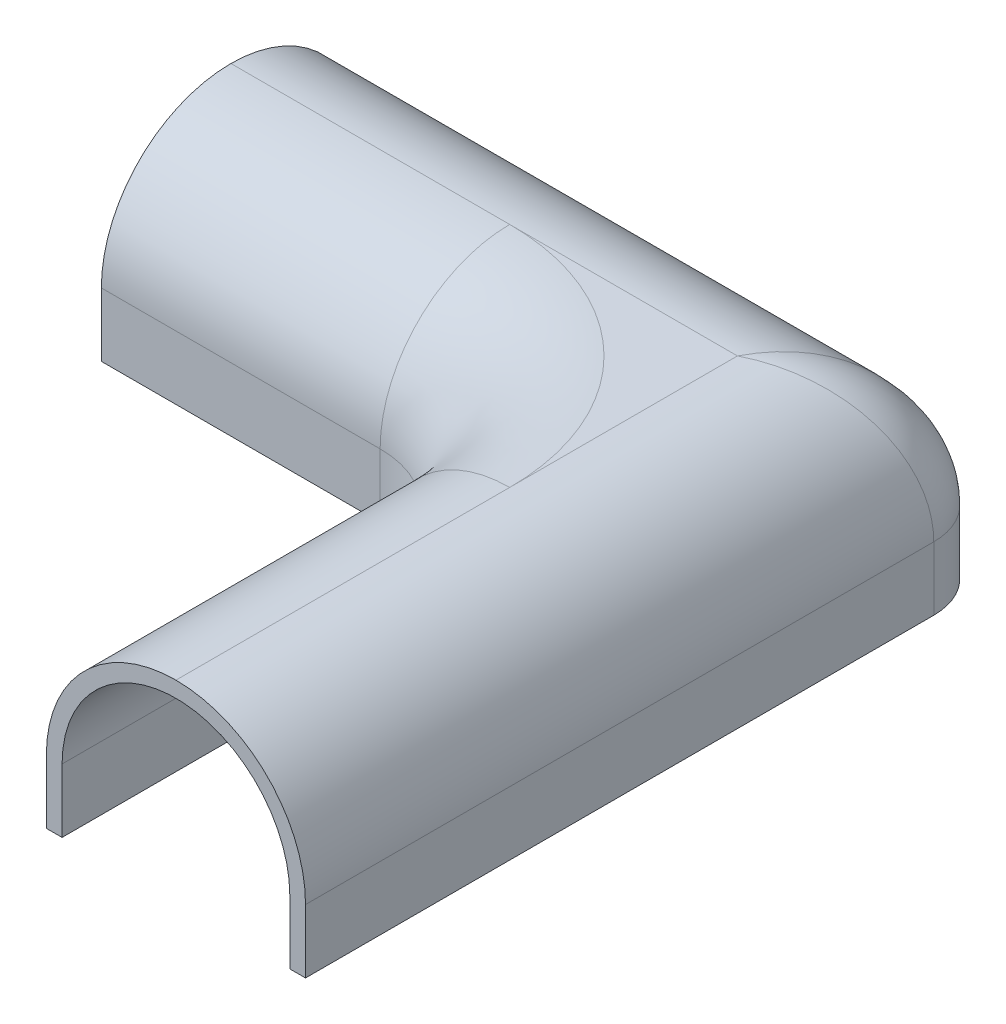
ISO-10303-21;
HEADER;
FILE_DESCRIPTION(('STEP AP214'),'2;1');
FILE_NAME('part.step','',(''),(''),'','','');
FILE_SCHEMA(('AUTOMOTIVE_DESIGN { 1 0 10303 214 1 1 1 1 }'));
ENDSEC;
DATA;
#1=APPLICATION_CONTEXT('core data for automotive mechanical design processes');
#2=APPLICATION_PROTOCOL_DEFINITION('international standard','automotive_design',2000,#1);
#3=PRODUCT_CONTEXT('',#1,'mechanical');
#4=PRODUCT('Part','Part','',(#3));
#5=PRODUCT_RELATED_PRODUCT_CATEGORY('part','',(#4));
#6=PRODUCT_DEFINITION_FORMATION('','',#4);
#7=PRODUCT_DEFINITION_CONTEXT('part definition',#1,'design');
#8=PRODUCT_DEFINITION('design','',#6,#7);
#9=PRODUCT_DEFINITION_SHAPE('','',#8);
#10=(LENGTH_UNIT() NAMED_UNIT(*) SI_UNIT(.MILLI.,.METRE.));
#11=(NAMED_UNIT(*) PLANE_ANGLE_UNIT() SI_UNIT($,.RADIAN.));
#12=(NAMED_UNIT(*) SI_UNIT($,.STERADIAN.) SOLID_ANGLE_UNIT());
#13=UNCERTAINTY_MEASURE_WITH_UNIT(LENGTH_MEASURE(1.E-05),#10,'distance_accuracy_value','');
#14=(GEOMETRIC_REPRESENTATION_CONTEXT(3) GLOBAL_UNCERTAINTY_ASSIGNED_CONTEXT((#13)) GLOBAL_UNIT_ASSIGNED_CONTEXT((#10,
#11,#12)) REPRESENTATION_CONTEXT('',''));
#15=CARTESIAN_POINT('',(0.,0.,0.));
#16=DIRECTION('',(0.,0.,1.));
#17=DIRECTION('',(1.,0.,0.));
#18=AXIS2_PLACEMENT_3D('',#15,#16,#17);
#19=CARTESIAN_POINT('',(-32.25,12.3,-8.25));
#20=DIRECTION('',(1.,0.,0.));
#21=DIRECTION('',(0.,0.,-1.));
#22=AXIS2_PLACEMENT_3D('',#19,#20,#21);
#23=PLANE('',#22);
#24=CARTESIAN_POINT('',(-32.25,4.05,0.));
#25=DIRECTION('',(1.,0.,0.));
#26=DIRECTION('',(0.,0.,-1.));
#27=AXIS2_PLACEMENT_3D('',#24,#25,#26);
#28=CIRCLE('',#27,8.25);
#29=CARTESIAN_POINT('',(-32.25,4.05,8.25));
#30=VERTEX_POINT('',#29);
#31=CARTESIAN_POINT('',(-32.25,12.3,0.));
#32=VERTEX_POINT('',#31);
#33=EDGE_CURVE('E380',#30,#32,#28,.F.);
#34=ORIENTED_EDGE('',*,*,#33,.T.);
#35=CARTESIAN_POINT('',(-32.25,4.05,0.));
#36=DIRECTION('',(1.,0.,0.));
#37=DIRECTION('',(0.,0.,-1.));
#38=AXIS2_PLACEMENT_3D('',#35,#36,#37);
#39=CIRCLE('',#38,8.25);
#40=CARTESIAN_POINT('',(-32.25,4.05,-8.25));
#41=VERTEX_POINT('',#40);
#42=EDGE_CURVE('E47',#32,#41,#39,.F.);
#43=ORIENTED_EDGE('',*,*,#42,.T.);
#44=DIRECTION('',(0.,-1.,0.));
#45=VECTOR('',#44,1.);
#46=CARTESIAN_POINT('',(-32.25,12.3,-8.25));
#47=LINE('',#46,#45);
#48=CARTESIAN_POINT('',(-32.25,0.,-8.25));
#49=VERTEX_POINT('',#48);
#50=EDGE_CURVE('E307',#41,#49,#47,.T.);
#51=ORIENTED_EDGE('',*,*,#50,.T.);
#52=DIRECTION('',(0.,0.,1.));
#53=VECTOR('',#52,1.);
#54=CARTESIAN_POINT('',(-32.25,0.,-8.25));
#55=LINE('',#54,#53);
#56=CARTESIAN_POINT('',(-32.25,0.,8.25));
#57=VERTEX_POINT('',#56);
#58=EDGE_CURVE('E274',#49,#57,#55,.T.);
#59=ORIENTED_EDGE('',*,*,#58,.T.);
#60=DIRECTION('',(0.,-1.,0.));
#61=VECTOR('',#60,1.);
#62=CARTESIAN_POINT('',(-32.25,12.3,8.25));
#63=LINE('',#62,#61);
#64=EDGE_CURVE('E314',#30,#57,#63,.T.);
#65=ORIENTED_EDGE('',*,*,#64,.F.);
#66=EDGE_LOOP('',(#34,#43,#51,#59,#65));
#67=FACE_BOUND('',#66,.T.);
#68=ADVANCED_FACE('F33',(#67),#23,.F.);
#69=CARTESIAN_POINT('',(-8.24999999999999,12.3,8.25));
#70=DIRECTION('',(0.,0.,-1.));
#71=DIRECTION('',(-1.,0.,0.));
#72=AXIS2_PLACEMENT_3D('',#69,#70,#71);
#73=PLANE('',#72);
#74=DIRECTION('',(0.,-1.,0.));
#75=VECTOR('',#74,1.);
#76=CARTESIAN_POINT('',(-14.5,12.3,8.25));
#77=LINE('',#76,#75);
#78=CARTESIAN_POINT('',(-14.5,0.,8.25));
#79=VERTEX_POINT('',#78);
#80=CARTESIAN_POINT('',(-14.5,4.05,8.25));
#81=VERTEX_POINT('',#80);
#82=EDGE_CURVE('E318',#79,#81,#77,.F.);
#83=ORIENTED_EDGE('',*,*,#82,.T.);
#84=DIRECTION('',(1.,0.,0.));
#85=VECTOR('',#84,1.);
#86=CARTESIAN_POINT('',(-32.25,4.05,8.25));
#87=LINE('',#86,#85);
#88=EDGE_CURVE('E11',#81,#30,#87,.F.);
#89=ORIENTED_EDGE('',*,*,#88,.T.);
#90=ORIENTED_EDGE('',*,*,#64,.T.);
#91=DIRECTION('',(1.,0.,0.));
#92=VECTOR('',#91,1.);
#93=CARTESIAN_POINT('',(-8.24999999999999,0.,8.25));
#94=LINE('',#93,#92);
#95=EDGE_CURVE('E293',#57,#79,#94,.T.);
#96=ORIENTED_EDGE('',*,*,#95,.T.);
#97=EDGE_LOOP('',(#83,#89,#90,#96));
#98=FACE_BOUND('',#97,.T.);
#99=ADVANCED_FACE('F465',(#98),#73,.F.);
#100=CARTESIAN_POINT('',(-8.24999999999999,12.3,35.75));
#101=DIRECTION('',(1.,0.,0.));
#102=DIRECTION('',(0.,0.,-1.));
#103=AXIS2_PLACEMENT_3D('',#100,#101,#102);
#104=PLANE('',#103);
#105=DIRECTION('',(0.,-1.,0.));
#106=VECTOR('',#105,1.);
#107=CARTESIAN_POINT('',(-8.24999999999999,12.3,35.75));
#108=LINE('',#107,#106);
#109=CARTESIAN_POINT('',(-8.24999999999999,4.05,35.75));
#110=VERTEX_POINT('',#109);
#111=CARTESIAN_POINT('',(-8.24999999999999,0.,35.75));
#112=VERTEX_POINT('',#111);
#113=EDGE_CURVE('E312',#110,#112,#108,.T.);
#114=ORIENTED_EDGE('',*,*,#113,.F.);
#115=DIRECTION('',(0.,0.,1.));
#116=VECTOR('',#115,1.);
#117=CARTESIAN_POINT('',(-8.24999999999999,4.05,14.5));
#118=LINE('',#117,#116);
#119=CARTESIAN_POINT('',(-8.24999999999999,4.05,14.5));
#120=VERTEX_POINT('',#119);
#121=EDGE_CURVE('E376',#110,#120,#118,.F.);
#122=ORIENTED_EDGE('',*,*,#121,.T.);
#123=DIRECTION('',(0.,-1.,0.));
#124=VECTOR('',#123,1.);
#125=CARTESIAN_POINT('',(-8.24999999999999,0.,14.5));
#126=LINE('',#125,#124);
#127=CARTESIAN_POINT('',(-8.24999999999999,0.,14.5));
#128=VERTEX_POINT('',#127);
#129=EDGE_CURVE('E316',#120,#128,#126,.T.);
#130=ORIENTED_EDGE('',*,*,#129,.T.);
#131=DIRECTION('',(0.,0.,1.));
#132=VECTOR('',#131,1.);
#133=CARTESIAN_POINT('',(-8.24999999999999,0.,35.75));
#134=LINE('',#133,#132);
#135=EDGE_CURVE('E296',#128,#112,#134,.T.);
#136=ORIENTED_EDGE('',*,*,#135,.T.);
#137=EDGE_LOOP('',(#114,#122,#130,#136));
#138=FACE_BOUND('',#137,.T.);
#139=ADVANCED_FACE('F469',(#138),#104,.F.);
#140=CARTESIAN_POINT('',(-8.24999999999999,12.3,35.75));
#141=DIRECTION('',(0.,0.,-1.));
#142=DIRECTION('',(-1.,0.,0.));
#143=AXIS2_PLACEMENT_3D('',#140,#141,#142);
#144=PLANE('',#143);
#145=CARTESIAN_POINT('',(0.,4.04999999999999,35.75));
#146=DIRECTION('',(0.,0.,1.));
#147=DIRECTION('',(-1.,0.,0.));
#148=AXIS2_PLACEMENT_3D('',#145,#146,#147);
#149=CIRCLE('',#148,7.25);
#150=CARTESIAN_POINT('',(7.25000000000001,4.05,35.75));
#151=VERTEX_POINT('',#150);
#152=CARTESIAN_POINT('',(-7.25,4.05,35.75));
#153=VERTEX_POINT('',#152);
#154=EDGE_CURVE('E191',#151,#153,#149,.T.);
#155=ORIENTED_EDGE('',*,*,#154,.F.);
#156=DIRECTION('',(0.,1.,0.));
#157=VECTOR('',#156,1.);
#158=CARTESIAN_POINT('',(7.25000000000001,4.05,35.75));
#159=LINE('',#158,#157);
#160=CARTESIAN_POINT('',(7.25000000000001,0.,35.75));
#161=VERTEX_POINT('',#160);
#162=EDGE_CURVE('E202',#161,#151,#159,.T.);
#163=ORIENTED_EDGE('',*,*,#162,.F.);
#164=DIRECTION('',(1.,0.,0.));
#165=VECTOR('',#164,1.);
#166=CARTESIAN_POINT('',(-8.24999999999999,0.,35.75));
#167=LINE('',#166,#165);
#168=CARTESIAN_POINT('',(8.25000000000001,0.,35.75));
#169=VERTEX_POINT('',#168);
#170=EDGE_CURVE('E299',#161,#169,#167,.T.);
#171=ORIENTED_EDGE('',*,*,#170,.T.);
#172=DIRECTION('',(0.,-1.,0.));
#173=VECTOR('',#172,1.);
#174=CARTESIAN_POINT('',(8.25000000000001,12.3,35.75));
#175=LINE('',#174,#173);
#176=CARTESIAN_POINT('',(8.25000000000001,4.05,35.75));
#177=VERTEX_POINT('',#176);
#178=EDGE_CURVE('E309',#177,#169,#175,.T.);
#179=ORIENTED_EDGE('',*,*,#178,.F.);
#180=CARTESIAN_POINT('',(0.,4.05,35.75));
#181=DIRECTION('',(0.,0.,-1.));
#182=DIRECTION('',(-1.,0.,0.));
#183=AXIS2_PLACEMENT_3D('',#180,#181,#182);
#184=CIRCLE('',#183,8.25);
#185=CARTESIAN_POINT('',(0.,12.3,35.75));
#186=VERTEX_POINT('',#185);
#187=EDGE_CURVE('E372',#177,#186,#184,.F.);
#188=ORIENTED_EDGE('',*,*,#187,.T.);
#189=CARTESIAN_POINT('',(0.,4.05,35.75));
#190=DIRECTION('',(0.,0.,-1.));
#191=DIRECTION('',(-1.,0.,0.));
#192=AXIS2_PLACEMENT_3D('',#189,#190,#191);
#193=CIRCLE('',#192,8.25);
#194=EDGE_CURVE('E370',#186,#110,#193,.F.);
#195=ORIENTED_EDGE('',*,*,#194,.T.);
#196=ORIENTED_EDGE('',*,*,#113,.T.);
#197=CARTESIAN_POINT('',(-7.25,0.,35.75));
#198=VERTEX_POINT('',#197);
#199=EDGE_CURVE('E201',#112,#198,#167,.T.);
#200=ORIENTED_EDGE('',*,*,#199,.T.);
#201=DIRECTION('',(0.,-1.,0.));
#202=VECTOR('',#201,1.);
#203=CARTESIAN_POINT('',(-7.25,4.05,35.75));
#204=LINE('',#203,#202);
#205=EDGE_CURVE('E180',#153,#198,#204,.T.);
#206=ORIENTED_EDGE('',*,*,#205,.F.);
#207=EDGE_LOOP('',(#155,#163,#171,#179,#188,#195,#196,#200,#206));
#208=FACE_BOUND('',#207,.T.);
#209=ADVANCED_FACE('F199',(#208),#144,.F.);
#210=CARTESIAN_POINT('',(8.25,12.3,-8.25));
#211=DIRECTION('',(-1.,0.,0.));
#212=DIRECTION('',(0.,0.,1.));
#213=AXIS2_PLACEMENT_3D('',#210,#211,#212);
#214=PLANE('',#213);
#215=DIRECTION('',(0.,-1.,0.));
#216=VECTOR('',#215,1.);
#217=CARTESIAN_POINT('',(8.25,12.3,-4.25));
#218=LINE('',#217,#216);
#219=CARTESIAN_POINT('',(8.25,0.,-4.25));
#220=VERTEX_POINT('',#219);
#221=CARTESIAN_POINT('',(8.25,4.05,-4.25));
#222=VERTEX_POINT('',#221);
#223=EDGE_CURVE('E338',#220,#222,#218,.F.);
#224=ORIENTED_EDGE('',*,*,#223,.T.);
#225=DIRECTION('',(0.,0.,-1.));
#226=VECTOR('',#225,1.);
#227=CARTESIAN_POINT('',(8.25000000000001,4.05,35.75));
#228=LINE('',#227,#226);
#229=EDGE_CURVE('E367',#222,#177,#228,.F.);
#230=ORIENTED_EDGE('',*,*,#229,.T.);
#231=ORIENTED_EDGE('',*,*,#178,.T.);
#232=DIRECTION('',(0.,0.,-1.));
#233=VECTOR('',#232,1.);
#234=CARTESIAN_POINT('',(8.25,0.,-8.25));
#235=LINE('',#234,#233);
#236=EDGE_CURVE('E301',#169,#220,#235,.T.);
#237=ORIENTED_EDGE('',*,*,#236,.T.);
#238=EDGE_LOOP('',(#224,#230,#231,#237));
#239=FACE_BOUND('',#238,.T.);
#240=ADVANCED_FACE('F401',(#239),#214,.F.);
#241=CARTESIAN_POINT('',(-32.25,12.3,-8.25));
#242=DIRECTION('',(0.,0.,1.));
#243=DIRECTION('',(1.,0.,0.));
#244=AXIS2_PLACEMENT_3D('',#241,#242,#243);
#245=PLANE('',#244);
#246=ORIENTED_EDGE('',*,*,#50,.F.);
#247=DIRECTION('',(-1.,0.,0.));
#248=VECTOR('',#247,1.);
#249=CARTESIAN_POINT('',(4.25,4.05,-8.25));
#250=LINE('',#249,#248);
#251=CARTESIAN_POINT('',(4.25,4.05,-8.25));
#252=VERTEX_POINT('',#251);
#253=EDGE_CURVE('E40',#41,#252,#250,.F.);
#254=ORIENTED_EDGE('',*,*,#253,.T.);
#255=DIRECTION('',(0.,-1.,0.));
#256=VECTOR('',#255,1.);
#257=CARTESIAN_POINT('',(4.25,12.3,-8.25));
#258=LINE('',#257,#256);
#259=CARTESIAN_POINT('',(4.25,0.,-8.25));
#260=VERTEX_POINT('',#259);
#261=EDGE_CURVE('E334',#252,#260,#258,.T.);
#262=ORIENTED_EDGE('',*,*,#261,.T.);
#263=DIRECTION('',(-1.,0.,0.));
#264=VECTOR('',#263,1.);
#265=CARTESIAN_POINT('',(-32.25,0.,-8.25));
#266=LINE('',#265,#264);
#267=EDGE_CURVE('E304',#260,#49,#266,.T.);
#268=ORIENTED_EDGE('',*,*,#267,.T.);
#269=EDGE_LOOP('',(#246,#254,#262,#268));
#270=FACE_BOUND('',#269,.T.);
#271=ADVANCED_FACE('F385',(#270),#245,.F.);
#272=CARTESIAN_POINT('',(-32.25,12.3,35.75));
#273=DIRECTION('',(0.,1.,0.));
#274=DIRECTION('',(0.,0.,1.));
#275=AXIS2_PLACEMENT_3D('',#272,#273,#274);
#276=PLANE('',#275);
#277=CARTESIAN_POINT('',(-14.5,12.3,14.5));
#278=DIRECTION('',(0.,1.,0.));
#279=DIRECTION('',(0.,0.,1.));
#280=AXIS2_PLACEMENT_3D('',#277,#278,#279);
#281=CIRCLE('',#280,14.5);
#282=CARTESIAN_POINT('',(-14.5,12.3,0.));
#283=VERTEX_POINT('',#282);
#284=CARTESIAN_POINT('',(0.,12.3,14.5));
#285=VERTEX_POINT('',#284);
#286=EDGE_CURVE('E362',#283,#285,#281,.F.);
#287=ORIENTED_EDGE('',*,*,#286,.T.);
#288=DIRECTION('',(0.,0.,-1.));
#289=VECTOR('',#288,1.);
#290=CARTESIAN_POINT('',(0.,12.3,-4.25));
#291=LINE('',#290,#289);
#292=CARTESIAN_POINT('',(0.,12.3,0.));
#293=VERTEX_POINT('',#292);
#294=EDGE_CURVE('E364',#285,#293,#291,.T.);
#295=ORIENTED_EDGE('',*,*,#294,.T.);
#296=DIRECTION('',(-1.,0.,0.));
#297=VECTOR('',#296,1.);
#298=CARTESIAN_POINT('',(-32.25,12.3,0.));
#299=LINE('',#298,#297);
#300=EDGE_CURVE('E360',#293,#283,#299,.T.);
#301=ORIENTED_EDGE('',*,*,#300,.T.);
#302=EDGE_LOOP('',(#287,#295,#301));
#303=FACE_BOUND('',#302,.T.);
#304=ADVANCED_FACE('F482',(#303),#276,.T.);
#305=CARTESIAN_POINT('',(-32.25,0.,35.75));
#306=DIRECTION('',(0.,1.,0.));
#307=DIRECTION('',(0.,0.,1.));
#308=AXIS2_PLACEMENT_3D('',#305,#306,#307);
#309=PLANE('',#308);
#310=ORIENTED_EDGE('',*,*,#170,.F.);
#311=DIRECTION('',(0.,0.,-1.));
#312=VECTOR('',#311,1.);
#313=CARTESIAN_POINT('',(7.25,0.,-8.25));
#314=LINE('',#313,#312);
#315=CARTESIAN_POINT('',(7.25,0.,-4.25));
#316=VERTEX_POINT('',#315);
#317=EDGE_CURVE('E284',#161,#316,#314,.T.);
#318=ORIENTED_EDGE('',*,*,#317,.T.);
#319=CARTESIAN_POINT('',(4.25,0.,-4.25));
#320=DIRECTION('',(0.,1.,0.));
#321=DIRECTION('',(0.,0.,1.));
#322=AXIS2_PLACEMENT_3D('',#319,#320,#321);
#323=CIRCLE('',#322,3.);
#324=CARTESIAN_POINT('',(4.25,0.,-7.25));
#325=VERTEX_POINT('',#324);
#326=EDGE_CURVE('E332',#316,#325,#323,.T.);
#327=ORIENTED_EDGE('',*,*,#326,.T.);
#328=DIRECTION('',(-1.,0.,0.));
#329=VECTOR('',#328,1.);
#330=CARTESIAN_POINT('',(-32.25,0.,-7.25));
#331=LINE('',#330,#329);
#332=CARTESIAN_POINT('',(-31.25,0.,-7.25));
#333=VERTEX_POINT('',#332);
#334=EDGE_CURVE('E277',#325,#333,#331,.T.);
#335=ORIENTED_EDGE('',*,*,#334,.T.);
#336=DIRECTION('',(0.,0.,1.));
#337=VECTOR('',#336,1.);
#338=CARTESIAN_POINT('',(-31.25,0.,-8.25));
#339=LINE('',#338,#337);
#340=CARTESIAN_POINT('',(-31.25,0.,7.25));
#341=VERTEX_POINT('',#340);
#342=EDGE_CURVE('E278',#333,#341,#339,.T.);
#343=ORIENTED_EDGE('',*,*,#342,.T.);
#344=DIRECTION('',(1.,0.,0.));
#345=VECTOR('',#344,1.);
#346=CARTESIAN_POINT('',(-8.24999999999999,0.,7.25));
#347=LINE('',#346,#345);
#348=CARTESIAN_POINT('',(-14.5,0.,7.25));
#349=VERTEX_POINT('',#348);
#350=EDGE_CURVE('E281',#341,#349,#347,.T.);
#351=ORIENTED_EDGE('',*,*,#350,.T.);
#352=CARTESIAN_POINT('',(-14.5,0.,14.5));
#353=DIRECTION('',(0.,1.,0.));
#354=DIRECTION('',(0.,0.,1.));
#355=AXIS2_PLACEMENT_3D('',#352,#353,#354);
#356=CIRCLE('',#355,7.25);
#357=CARTESIAN_POINT('',(-7.25,0.,14.5));
#358=VERTEX_POINT('',#357);
#359=EDGE_CURVE('E324',#349,#358,#356,.F.);
#360=ORIENTED_EDGE('',*,*,#359,.T.);
#361=DIRECTION('',(0.,0.,1.));
#362=VECTOR('',#361,1.);
#363=CARTESIAN_POINT('',(-7.25,0.,35.75));
#364=LINE('',#363,#362);
#365=EDGE_CURVE('E287',#358,#198,#364,.T.);
#366=ORIENTED_EDGE('',*,*,#365,.T.);
#367=ORIENTED_EDGE('',*,*,#199,.F.);
#368=ORIENTED_EDGE('',*,*,#135,.F.);
#369=CARTESIAN_POINT('',(-14.5,0.,14.5));
#370=DIRECTION('',(0.,1.,0.));
#371=DIRECTION('',(0.,0.,1.));
#372=AXIS2_PLACEMENT_3D('',#369,#370,#371);
#373=CIRCLE('',#372,6.25);
#374=EDGE_CURVE('E320',#128,#79,#373,.T.);
#375=ORIENTED_EDGE('',*,*,#374,.T.);
#376=ORIENTED_EDGE('',*,*,#95,.F.);
#377=ORIENTED_EDGE('',*,*,#58,.F.);
#378=ORIENTED_EDGE('',*,*,#267,.F.);
#379=CARTESIAN_POINT('',(4.25,0.,-4.25));
#380=DIRECTION('',(0.,1.,0.));
#381=DIRECTION('',(0.,0.,1.));
#382=AXIS2_PLACEMENT_3D('',#379,#380,#381);
#383=CIRCLE('',#382,4.);
#384=EDGE_CURVE('E336',#260,#220,#383,.F.);
#385=ORIENTED_EDGE('',*,*,#384,.T.);
#386=ORIENTED_EDGE('',*,*,#236,.F.);
#387=EDGE_LOOP('',(#310,#318,#327,#335,#343,#351,#360,#366,#367,#368,#375,#376,#377,#378,#385,#386));
#388=FACE_BOUND('',#387,.T.);
#389=ADVANCED_FACE('F406',(#388),#309,.F.);
#390=CARTESIAN_POINT('',(-31.25,12.3,-8.25));
#391=DIRECTION('',(1.,0.,0.));
#392=DIRECTION('',(0.,0.,-1.));
#393=AXIS2_PLACEMENT_3D('',#390,#391,#392);
#394=PLANE('',#393);
#395=CARTESIAN_POINT('',(-31.25,4.05,0.));
#396=DIRECTION('',(1.,0.,0.));
#397=DIRECTION('',(0.,0.,-1.));
#398=AXIS2_PLACEMENT_3D('',#395,#396,#397);
#399=CIRCLE('',#398,7.25);
#400=CARTESIAN_POINT('',(-31.25,4.05,-7.25));
#401=VERTEX_POINT('',#400);
#402=CARTESIAN_POINT('',(-31.25,11.3,0.));
#403=VERTEX_POINT('',#402);
#404=EDGE_CURVE('E344',#401,#403,#399,.T.);
#405=ORIENTED_EDGE('',*,*,#404,.T.);
#406=CARTESIAN_POINT('',(-31.25,4.05,0.));
#407=DIRECTION('',(1.,0.,0.));
#408=DIRECTION('',(0.,0.,-1.));
#409=AXIS2_PLACEMENT_3D('',#406,#407,#408);
#410=CIRCLE('',#409,7.25);
#411=CARTESIAN_POINT('',(-31.25,4.05,7.25));
#412=VERTEX_POINT('',#411);
#413=EDGE_CURVE('E346',#403,#412,#410,.T.);
#414=ORIENTED_EDGE('',*,*,#413,.T.);
#415=DIRECTION('',(0.,-1.,0.));
#416=VECTOR('',#415,1.);
#417=CARTESIAN_POINT('',(-31.25,12.3,7.25));
#418=LINE('',#417,#416);
#419=EDGE_CURVE('E272',#412,#341,#418,.T.);
#420=ORIENTED_EDGE('',*,*,#419,.T.);
#421=ORIENTED_EDGE('',*,*,#342,.F.);
#422=DIRECTION('',(0.,-1.,0.));
#423=VECTOR('',#422,1.);
#424=CARTESIAN_POINT('',(-31.25,12.3,-7.25));
#425=LINE('',#424,#423);
#426=EDGE_CURVE('E275',#401,#333,#425,.T.);
#427=ORIENTED_EDGE('',*,*,#426,.F.);
#428=EDGE_LOOP('',(#405,#414,#420,#421,#427));
#429=FACE_BOUND('',#428,.T.);
#430=ADVANCED_FACE('F445',(#429),#394,.T.);
#431=CARTESIAN_POINT('',(-8.24999999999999,12.3,7.25));
#432=DIRECTION('',(0.,0.,-1.));
#433=DIRECTION('',(-1.,0.,0.));
#434=AXIS2_PLACEMENT_3D('',#431,#432,#433);
#435=PLANE('',#434);
#436=ORIENTED_EDGE('',*,*,#419,.F.);
#437=DIRECTION('',(1.,0.,0.));
#438=VECTOR('',#437,1.);
#439=CARTESIAN_POINT('',(-8.24999999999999,4.05,7.25));
#440=LINE('',#439,#438);
#441=CARTESIAN_POINT('',(-14.5,4.05,7.25));
#442=VERTEX_POINT('',#441);
#443=EDGE_CURVE('E341',#412,#442,#440,.T.);
#444=ORIENTED_EDGE('',*,*,#443,.T.);
#445=DIRECTION('',(0.,-1.,0.));
#446=VECTOR('',#445,1.);
#447=CARTESIAN_POINT('',(-14.5,12.3,7.25));
#448=LINE('',#447,#446);
#449=EDGE_CURVE('E322',#442,#349,#448,.T.);
#450=ORIENTED_EDGE('',*,*,#449,.T.);
#451=ORIENTED_EDGE('',*,*,#350,.F.);
#452=EDGE_LOOP('',(#436,#444,#450,#451));
#453=FACE_BOUND('',#452,.T.);
#454=ADVANCED_FACE('F462',(#453),#435,.T.);
#455=CARTESIAN_POINT('',(-7.25,12.3,35.75));
#456=DIRECTION('',(1.,0.,0.));
#457=DIRECTION('',(0.,0.,-1.));
#458=AXIS2_PLACEMENT_3D('',#455,#456,#457);
#459=PLANE('',#458);
#460=DIRECTION('',(0.,-1.,0.));
#461=VECTOR('',#460,1.);
#462=CARTESIAN_POINT('',(-7.25,12.3,14.5));
#463=LINE('',#462,#461);
#464=CARTESIAN_POINT('',(-7.25,4.05,14.5));
#465=VERTEX_POINT('',#464);
#466=EDGE_CURVE('E183',#358,#465,#463,.F.);
#467=ORIENTED_EDGE('',*,*,#466,.T.);
#468=DIRECTION('',(0.,0.,1.));
#469=VECTOR('',#468,1.);
#470=CARTESIAN_POINT('',(-7.25,4.05,35.75));
#471=LINE('',#470,#469);
#472=EDGE_CURVE('E175',#465,#153,#471,.T.);
#473=ORIENTED_EDGE('',*,*,#472,.T.);
#474=ORIENTED_EDGE('',*,*,#205,.T.);
#475=ORIENTED_EDGE('',*,*,#365,.F.);
#476=EDGE_LOOP('',(#467,#473,#474,#475));
#477=FACE_BOUND('',#476,.T.);
#478=ADVANCED_FACE('F177',(#477),#459,.T.);
#479=CARTESIAN_POINT('',(7.25,12.3,-8.25));
#480=DIRECTION('',(-1.,0.,0.));
#481=DIRECTION('',(0.,0.,1.));
#482=AXIS2_PLACEMENT_3D('',#479,#480,#481);
#483=PLANE('',#482);
#484=ORIENTED_EDGE('',*,*,#317,.F.);
#485=ORIENTED_EDGE('',*,*,#162,.T.);
#486=DIRECTION('',(0.,0.,-1.));
#487=VECTOR('',#486,1.);
#488=CARTESIAN_POINT('',(7.25,4.05,-8.25));
#489=LINE('',#488,#487);
#490=CARTESIAN_POINT('',(7.25,4.05,-4.25));
#491=VERTEX_POINT('',#490);
#492=EDGE_CURVE('E194',#151,#491,#489,.T.);
#493=ORIENTED_EDGE('',*,*,#492,.T.);
#494=DIRECTION('',(0.,-1.,0.));
#495=VECTOR('',#494,1.);
#496=CARTESIAN_POINT('',(7.25,0.,-4.25));
#497=LINE('',#496,#495);
#498=EDGE_CURVE('E327',#491,#316,#497,.T.);
#499=ORIENTED_EDGE('',*,*,#498,.T.);
#500=EDGE_LOOP('',(#484,#485,#493,#499));
#501=FACE_BOUND('',#500,.T.);
#502=ADVANCED_FACE('F453',(#501),#483,.T.);
#503=CARTESIAN_POINT('',(-32.25,12.3,-7.25));
#504=DIRECTION('',(0.,0.,1.));
#505=DIRECTION('',(1.,0.,0.));
#506=AXIS2_PLACEMENT_3D('',#503,#504,#505);
#507=PLANE('',#506);
#508=DIRECTION('',(0.,-1.,0.));
#509=VECTOR('',#508,1.);
#510=CARTESIAN_POINT('',(4.25,11.3,-7.25));
#511=LINE('',#510,#509);
#512=CARTESIAN_POINT('',(4.25,4.05,-7.25));
#513=VERTEX_POINT('',#512);
#514=EDGE_CURVE('E329',#325,#513,#511,.F.);
#515=ORIENTED_EDGE('',*,*,#514,.T.);
#516=DIRECTION('',(-1.,0.,0.));
#517=VECTOR('',#516,1.);
#518=CARTESIAN_POINT('',(-32.25,4.05,-7.25));
#519=LINE('',#518,#517);
#520=EDGE_CURVE('E187',#513,#401,#519,.T.);
#521=ORIENTED_EDGE('',*,*,#520,.T.);
#522=ORIENTED_EDGE('',*,*,#426,.T.);
#523=ORIENTED_EDGE('',*,*,#334,.F.);
#524=EDGE_LOOP('',(#515,#521,#522,#523));
#525=FACE_BOUND('',#524,.T.);
#526=ADVANCED_FACE('F440',(#525),#507,.T.);
#527=CARTESIAN_POINT('',(-32.25,11.3,35.75));
#528=DIRECTION('',(0.,1.,0.));
#529=DIRECTION('',(0.,0.,1.));
#530=AXIS2_PLACEMENT_3D('',#527,#528,#529);
#531=PLANE('',#530);
#532=DIRECTION('',(0.,0.,-1.));
#533=VECTOR('',#532,1.);
#534=CARTESIAN_POINT('',(0.,11.3,35.75));
#535=LINE('',#534,#533);
#536=CARTESIAN_POINT('',(0.,11.3,0.));
#537=VERTEX_POINT('',#536);
#538=CARTESIAN_POINT('',(0.,11.3,14.5));
#539=VERTEX_POINT('',#538);
#540=EDGE_CURVE('E350',#537,#539,#535,.F.);
#541=ORIENTED_EDGE('',*,*,#540,.T.);
#542=CARTESIAN_POINT('',(-14.5,11.3,14.5));
#543=DIRECTION('',(0.,1.,0.));
#544=DIRECTION('',(0.,0.,1.));
#545=AXIS2_PLACEMENT_3D('',#542,#543,#544);
#546=CIRCLE('',#545,14.5);
#547=CARTESIAN_POINT('',(-14.5,11.3,0.));
#548=VERTEX_POINT('',#547);
#549=EDGE_CURVE('E352',#539,#548,#546,.T.);
#550=ORIENTED_EDGE('',*,*,#549,.T.);
#551=DIRECTION('',(-1.,0.,0.));
#552=VECTOR('',#551,1.);
#553=CARTESIAN_POINT('',(-32.25,11.3,0.));
#554=LINE('',#553,#552);
#555=EDGE_CURVE('E348',#548,#537,#554,.F.);
#556=ORIENTED_EDGE('',*,*,#555,.T.);
#557=EDGE_LOOP('',(#541,#550,#556));
#558=FACE_BOUND('',#557,.T.);
#559=ADVANCED_FACE('F460',(#558),#531,.F.);
#560=CARTESIAN_POINT('',(-14.5,12.3,14.5));
#561=DIRECTION('',(0.,1.,0.));
#562=DIRECTION('',(0.,0.,1.));
#563=AXIS2_PLACEMENT_3D('',#560,#561,#562);
#564=CYLINDRICAL_SURFACE('',#563,6.25);
#565=ORIENTED_EDGE('',*,*,#129,.F.);
#566=CARTESIAN_POINT('',(-14.5,4.05,14.5));
#567=DIRECTION('',(0.,1.,0.));
#568=DIRECTION('',(0.,0.,1.));
#569=AXIS2_PLACEMENT_3D('',#566,#567,#568);
#570=CIRCLE('',#569,6.25);
#571=EDGE_CURVE('E378',#120,#81,#570,.T.);
#572=ORIENTED_EDGE('',*,*,#571,.T.);
#573=ORIENTED_EDGE('',*,*,#82,.F.);
#574=ORIENTED_EDGE('',*,*,#374,.F.);
#575=EDGE_LOOP('',(#565,#572,#573,#574));
#576=FACE_BOUND('',#575,.T.);
#577=ADVANCED_FACE('F489',(#576),#564,.F.);
#578=CARTESIAN_POINT('',(-14.5,12.3,14.5));
#579=DIRECTION('',(0.,-1.,0.));
#580=DIRECTION('',(0.,0.,-1.));
#581=AXIS2_PLACEMENT_3D('',#578,#579,#580);
#582=CYLINDRICAL_SURFACE('',#581,7.25);
#583=ORIENTED_EDGE('',*,*,#449,.F.);
#584=CARTESIAN_POINT('',(-14.5,4.05,14.5));
#585=DIRECTION('',(0.,1.,0.));
#586=DIRECTION('',(0.,0.,1.));
#587=AXIS2_PLACEMENT_3D('',#584,#585,#586);
#588=CIRCLE('',#587,7.25);
#589=EDGE_CURVE('E355',#442,#465,#588,.F.);
#590=ORIENTED_EDGE('',*,*,#589,.T.);
#591=ORIENTED_EDGE('',*,*,#466,.F.);
#592=ORIENTED_EDGE('',*,*,#359,.F.);
#593=EDGE_LOOP('',(#583,#590,#591,#592));
#594=FACE_BOUND('',#593,.T.);
#595=ADVANCED_FACE('F494',(#594),#582,.T.);
#596=CARTESIAN_POINT('',(4.25,12.3,-4.25));
#597=DIRECTION('',(0.,1.,0.));
#598=DIRECTION('',(0.,0.,1.));
#599=AXIS2_PLACEMENT_3D('',#596,#597,#598);
#600=CYLINDRICAL_SURFACE('',#599,3.);
#601=ORIENTED_EDGE('',*,*,#498,.F.);
#602=CARTESIAN_POINT('',(4.25,4.05,-4.25));
#603=DIRECTION('',(0.,1.,0.));
#604=DIRECTION('',(0.,0.,1.));
#605=AXIS2_PLACEMENT_3D('',#602,#603,#604);
#606=CIRCLE('',#605,3.);
#607=EDGE_CURVE('E188',#491,#513,#606,.T.);
#608=ORIENTED_EDGE('',*,*,#607,.T.);
#609=ORIENTED_EDGE('',*,*,#514,.F.);
#610=ORIENTED_EDGE('',*,*,#326,.F.);
#611=EDGE_LOOP('',(#601,#608,#609,#610));
#612=FACE_BOUND('',#611,.T.);
#613=ADVANCED_FACE('F451',(#612),#600,.F.);
#614=CARTESIAN_POINT('',(4.25,12.3,-4.25));
#615=DIRECTION('',(0.,-1.,0.));
#616=DIRECTION('',(0.,0.,-1.));
#617=AXIS2_PLACEMENT_3D('',#614,#615,#616);
#618=CYLINDRICAL_SURFACE('',#617,4.);
#619=ORIENTED_EDGE('',*,*,#261,.F.);
#620=CARTESIAN_POINT('',(4.25,4.05,-4.25));
#621=DIRECTION('',(0.,-1.,0.));
#622=DIRECTION('',(0.,0.,-1.));
#623=AXIS2_PLACEMENT_3D('',#620,#621,#622);
#624=CIRCLE('',#623,4.);
#625=EDGE_CURVE('E374',#252,#222,#624,.T.);
#626=ORIENTED_EDGE('',*,*,#625,.T.);
#627=ORIENTED_EDGE('',*,*,#223,.F.);
#628=ORIENTED_EDGE('',*,*,#384,.F.);
#629=EDGE_LOOP('',(#619,#626,#627,#628));
#630=FACE_BOUND('',#629,.T.);
#631=ADVANCED_FACE('F389',(#630),#618,.T.);
#632=CARTESIAN_POINT('',(0.,4.05,-8.25));
#633=DIRECTION('',(0.,0.,-1.));
#634=DIRECTION('',(-1.,0.,0.));
#635=AXIS2_PLACEMENT_3D('',#632,#633,#634);
#636=CYLINDRICAL_SURFACE('',#635,7.25);
#637=CARTESIAN_POINT('',(0.,4.05,0.));
#638=DIRECTION('',(0.50571949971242,0.,0.862697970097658));
#639=DIRECTION('',(0.862697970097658,0.,-0.50571949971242));
#640=AXIS2_PLACEMENT_3D('',#637,#638,#639);
#641=ELLIPSE('',#640,8.4038681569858,7.25);
#642=EDGE_CURVE('E270',#491,#537,#641,.T.);
#643=ORIENTED_EDGE('',*,*,#642,.F.);
#644=ORIENTED_EDGE('',*,*,#492,.F.);
#645=ORIENTED_EDGE('',*,*,#154,.T.);
#646=ORIENTED_EDGE('',*,*,#472,.F.);
#647=CARTESIAN_POINT('',(0.,4.05,14.5));
#648=DIRECTION('',(0.,0.,1.));
#649=DIRECTION('',(1.,0.,0.));
#650=AXIS2_PLACEMENT_3D('',#647,#648,#649);
#651=CIRCLE('',#650,7.25);
#652=EDGE_CURVE('E424',#539,#465,#651,.T.);
#653=ORIENTED_EDGE('',*,*,#652,.F.);
#654=DIRECTION('',(0.,0.,-1.));
#655=VECTOR('',#654,1.);
#656=CARTESIAN_POINT('',(0.,11.3,35.75));
#657=LINE('',#656,#655);
#658=CARTESIAN_POINT('',(0.,11.3,34.75));
#659=VERTEX_POINT('',#658);
#660=EDGE_CURVE('E428',#539,#659,#657,.F.);
#661=ORIENTED_EDGE('',*,*,#660,.T.);
#662=ORIENTED_EDGE('',*,*,#660,.F.);
#663=ORIENTED_EDGE('',*,*,#540,.F.);
#664=EDGE_LOOP('',(#643,#644,#645,#646,#653,#661,#662,#663));
#665=FACE_BOUND('',#664,.T.);
#666=ADVANCED_FACE('F193',(#665),#636,.F.);
#667=CARTESIAN_POINT('',(0.,11.3,0.));
#668=CARTESIAN_POINT('',(0.,11.3,0.));
#669=CARTESIAN_POINT('',(0.,11.3,0.));
#670=CARTESIAN_POINT('',(0.157953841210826,11.2999909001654,-0.0925936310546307));
#671=CARTESIAN_POINT('',(0.125273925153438,11.2999978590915,-0.125273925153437));
#672=CARTESIAN_POINT('',(0.0925936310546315,11.2999909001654,-0.157953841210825));
#673=CARTESIAN_POINT('',(0.315884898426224,11.2948381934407,-0.185173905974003));
#674=CARTESIAN_POINT('',(0.250618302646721,11.2969727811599,-0.250618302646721));
#675=CARTESIAN_POINT('',(0.185173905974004,11.2948381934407,-0.315884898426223));
#676=CARTESIAN_POINT('',(0.631421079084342,11.2741842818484,-0.37014339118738));
#677=CARTESIAN_POINT('',(0.501291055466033,11.284845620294,-0.501291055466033));
#678=CARTESIAN_POINT('',(0.370143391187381,11.2741842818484,-0.631421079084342));
#679=CARTESIAN_POINT('',(0.789026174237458,11.2586822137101,-0.462532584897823));
#680=CARTESIAN_POINT('',(0.626798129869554,11.2757257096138,-0.626798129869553));
#681=CARTESIAN_POINT('',(0.462532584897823,11.2586822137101,-0.789026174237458));
#682=CARTESIAN_POINT('',(1.25812156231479,11.1969260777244,-0.737519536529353));
#683=CARTESIAN_POINT('',(1.001879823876,11.2392499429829,-1.001879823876));
#684=CARTESIAN_POINT('',(0.737519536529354,11.1969260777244,-1.25812156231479));
#685=CARTESIAN_POINT('',(1.56868492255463,11.1354224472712,-0.919573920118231));
#686=CARTESIAN_POINT('',(1.25222989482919,11.2026623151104,-1.25222989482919));
#687=CARTESIAN_POINT('',(0.919573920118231,11.1354224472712,-1.56868492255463));
#688=CARTESIAN_POINT('',(2.17902930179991,10.9718851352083,-1.2773620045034));
#689=CARTESIAN_POINT('',(1.74969295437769,11.1043806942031,-1.74969295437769));
#690=CARTESIAN_POINT('',(1.2773620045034,10.9718851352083,-2.17902930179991));
#691=CARTESIAN_POINT('',(2.47890380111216,10.8705485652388,-1.45315050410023));
#692=CARTESIAN_POINT('',(1.99820831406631,11.0425543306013,-1.99820831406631));
#693=CARTESIAN_POINT('',(1.45315050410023,10.8705485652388,-2.47890380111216));
#694=CARTESIAN_POINT('',(3.06272524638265,10.6287204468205,-1.79539066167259));
#695=CARTESIAN_POINT('',(2.49130619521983,10.8922902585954,-2.49130619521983));
#696=CARTESIAN_POINT('',(1.79539066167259,10.6287204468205,-3.06272524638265));
#697=CARTESIAN_POINT('',(3.34688257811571,10.4892549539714,-1.96196564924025));
#698=CARTESIAN_POINT('',(2.73724312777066,10.8036695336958,-2.73724312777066));
#699=CARTESIAN_POINT('',(1.96196564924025,10.4892549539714,-3.34688257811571));
#700=CARTESIAN_POINT('',(3.89426492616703,10.1732243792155,-2.2828449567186));
#701=CARTESIAN_POINT('',(3.22441719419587,10.5971194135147,-3.22441719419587));
#702=CARTESIAN_POINT('',(2.2828449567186,10.1732243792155,-3.89426492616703));
#703=CARTESIAN_POINT('',(4.15786832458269,9.99798147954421,-2.43737108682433));
#704=CARTESIAN_POINT('',(3.46691784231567,10.4789885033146,-3.46691784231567));
#705=CARTESIAN_POINT('',(2.43737108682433,9.9979814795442,-4.15786832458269));
#706=CARTESIAN_POINT('',(4.659459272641,9.61309513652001,-2.73140715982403));
#707=CARTESIAN_POINT('',(3.94611758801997,10.209009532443,-3.94611758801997));
#708=CARTESIAN_POINT('',(2.73140715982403,9.61309513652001,-4.659459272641));
#709=CARTESIAN_POINT('',(4.89803954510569,9.4050116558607,-2.87126456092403));
#710=CARTESIAN_POINT('',(4.1839232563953,10.0570092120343,-4.18392325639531));
#711=CARTESIAN_POINT('',(2.87126456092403,9.4050116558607,-4.89803954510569));
#712=CARTESIAN_POINT('',(5.345274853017,8.95777072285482,-3.13343698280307));
#713=CARTESIAN_POINT('',(4.65153023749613,9.71274207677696,-4.65153023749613));
#714=CARTESIAN_POINT('',(3.13343698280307,8.95777072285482,-5.345274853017));
#715=CARTESIAN_POINT('',(5.55477175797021,8.72031474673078,-3.25624551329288));
#716=CARTESIAN_POINT('',(4.88219236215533,9.52050007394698,-4.88219236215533));
#717=CARTESIAN_POINT('',(3.25624551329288,8.72031474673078,-5.55477175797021));
#718=CARTESIAN_POINT('',(5.93999511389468,8.21826838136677,-3.48206610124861));
#719=CARTESIAN_POINT('',(5.33093480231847,9.08719362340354,-5.33093480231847));
#720=CARTESIAN_POINT('',(3.48206610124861,8.21826838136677,-5.93999511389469));
#721=CARTESIAN_POINT('',(6.11681622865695,7.9553773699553,-3.58571985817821));
#722=CARTESIAN_POINT('',(5.54953059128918,8.84654704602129,-5.54953059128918));
#723=CARTESIAN_POINT('',(3.58571985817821,7.9553773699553,-6.11681622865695));
#724=CARTESIAN_POINT('',(6.43340336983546,7.40700525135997,-3.77130542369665));
#725=CARTESIAN_POINT('',(5.96550341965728,8.3074753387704,-5.96550341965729));
#726=CARTESIAN_POINT('',(3.77130542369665,7.40700525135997,-6.43340336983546));
#727=CARTESIAN_POINT('',(6.57446101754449,7.1230345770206,-3.85399438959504));
#728=CARTESIAN_POINT('',(6.16297703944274,8.01017862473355,-6.16297703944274));
#729=CARTESIAN_POINT('',(3.85399438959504,7.1230345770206,-6.57446101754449));
#730=CARTESIAN_POINT('',(6.81692316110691,6.53763106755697,-3.99612737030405));
#731=CARTESIAN_POINT('',(6.52280076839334,7.35257460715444,-6.52280076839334));
#732=CARTESIAN_POINT('',(3.99612737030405,6.53763106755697,-6.81692316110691));
#733=CARTESIAN_POINT('',(6.91967023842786,6.23732597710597,-4.05635841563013));
#734=CARTESIAN_POINT('',(6.68484901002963,6.99447763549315,-6.68484901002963));
#735=CARTESIAN_POINT('',(4.05635841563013,6.23732597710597,-6.91967023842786));
#736=CARTESIAN_POINT('',(7.08375327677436,5.62488504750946,-4.15254502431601));
#737=CARTESIAN_POINT('',(6.95586481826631,6.22019683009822,-6.95586481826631));
#738=CARTESIAN_POINT('',(4.15254502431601,5.62488504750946,-7.08375327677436));
#739=CARTESIAN_POINT('',(7.14624003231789,5.31337519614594,-4.18917519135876));
#740=CARTESIAN_POINT('',(7.06431733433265,5.80755809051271,-7.06431733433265));
#741=CARTESIAN_POINT('',(4.18917519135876,5.31337519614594,-7.14624003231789));
#742=CARTESIAN_POINT('',(7.22902572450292,4.68445647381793,-4.23770473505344));
#743=CARTESIAN_POINT('',(7.21158413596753,4.94432793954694,-7.21158413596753));
#744=CARTESIAN_POINT('',(4.23770473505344,4.68445647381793,-7.22902572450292));
#745=CARTESIAN_POINT('',(7.25,4.36722823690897,-4.25));
#746=CARTESIAN_POINT('',(7.25,4.49846883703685,-7.25));
#747=CARTESIAN_POINT('',(4.25,4.36722823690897,-7.25));
#748=CARTESIAN_POINT('',(7.25,3.73277176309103,-4.25));
#749=CARTESIAN_POINT('',(7.25,3.60153116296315,-7.25));
#750=CARTESIAN_POINT('',(4.25,3.73277176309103,-7.25));
#751=CARTESIAN_POINT('',(7.22902572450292,3.41554352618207,-4.23770473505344));
#752=CARTESIAN_POINT('',(7.21158413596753,3.15567206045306,-7.21158413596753));
#753=CARTESIAN_POINT('',(4.23770473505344,3.41554352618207,-7.22902572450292));
#754=CARTESIAN_POINT('',(7.14624003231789,2.78662480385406,-4.18917519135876));
#755=CARTESIAN_POINT('',(7.06431733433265,2.29244190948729,-7.06431733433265));
#756=CARTESIAN_POINT('',(4.18917519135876,2.78662480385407,-7.14624003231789));
#757=CARTESIAN_POINT('',(7.08375327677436,2.47511495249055,-4.15254502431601));
#758=CARTESIAN_POINT('',(6.95586481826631,1.87980316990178,-6.95586481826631));
#759=CARTESIAN_POINT('',(4.15254502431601,2.47511495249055,-7.08375327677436));
#760=CARTESIAN_POINT('',(6.91967023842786,1.86267402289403,-4.05635841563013));
#761=CARTESIAN_POINT('',(6.68484901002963,1.10552236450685,-6.68484901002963));
#762=CARTESIAN_POINT('',(4.05635841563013,1.86267402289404,-6.91967023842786));
#763=CARTESIAN_POINT('',(6.81692316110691,1.56236893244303,-3.99612737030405));
#764=CARTESIAN_POINT('',(6.52280076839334,0.747425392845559,-6.52280076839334));
#765=CARTESIAN_POINT('',(3.99612737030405,1.56236893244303,-6.81692316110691));
#766=CARTESIAN_POINT('',(6.57446101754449,0.976965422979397,-3.85399438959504));
#767=CARTESIAN_POINT('',(6.16297703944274,0.0898213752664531,-6.16297703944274));
#768=CARTESIAN_POINT('',(3.85399438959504,0.976965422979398,-6.57446101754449));
#769=CARTESIAN_POINT('',(6.43340336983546,0.692994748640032,-3.77130542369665));
#770=CARTESIAN_POINT('',(5.96550341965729,-0.207475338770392,-5.96550341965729));
#771=CARTESIAN_POINT('',(3.77130542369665,0.692994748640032,-6.43340336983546));
#772=CARTESIAN_POINT('',(6.11681622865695,0.144622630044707,-3.58571985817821));
#773=CARTESIAN_POINT('',(5.54953059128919,-0.746547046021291,-5.54953059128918));
#774=CARTESIAN_POINT('',(3.58571985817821,0.144622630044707,-6.11681622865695));
#775=CARTESIAN_POINT('',(5.93999511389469,-0.118268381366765,-3.48206610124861));
#776=CARTESIAN_POINT('',(5.33093480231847,-0.987193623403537,-5.33093480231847));
#777=CARTESIAN_POINT('',(3.48206610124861,-0.118268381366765,-5.93999511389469));
#778=CARTESIAN_POINT('',(5.55477175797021,-0.620314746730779,-3.25624551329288));
#779=CARTESIAN_POINT('',(4.88219236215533,-1.42050007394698,-4.88219236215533));
#780=CARTESIAN_POINT('',(3.25624551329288,-0.620314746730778,-5.55477175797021));
#781=CARTESIAN_POINT('',(5.345274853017,-0.85777072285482,-3.13343698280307));
#782=CARTESIAN_POINT('',(4.65153023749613,-1.61274207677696,-4.65153023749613));
#783=CARTESIAN_POINT('',(3.13343698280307,-0.857770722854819,-5.345274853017));
#784=CARTESIAN_POINT('',(4.89803954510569,-1.3050116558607,-2.87126456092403));
#785=CARTESIAN_POINT('',(4.18392325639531,-1.95700921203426,-4.18392325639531));
#786=CARTESIAN_POINT('',(2.87126456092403,-1.3050116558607,-4.89803954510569));
#787=CARTESIAN_POINT('',(4.659459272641,-1.51309513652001,-2.73140715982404));
#788=CARTESIAN_POINT('',(3.94611758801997,-2.109009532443,-3.94611758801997));
#789=CARTESIAN_POINT('',(2.73140715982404,-1.51309513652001,-4.659459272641));
#790=CARTESIAN_POINT('',(4.15786832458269,-1.89798147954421,-2.43737108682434));
#791=CARTESIAN_POINT('',(3.46691784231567,-2.37898850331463,-3.46691784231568));
#792=CARTESIAN_POINT('',(2.43737108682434,-1.8979814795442,-4.15786832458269));
#793=CARTESIAN_POINT('',(3.89426492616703,-2.07322437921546,-2.28284495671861));
#794=CARTESIAN_POINT('',(3.22441719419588,-2.49711941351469,-3.22441719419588));
#795=CARTESIAN_POINT('',(2.28284495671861,-2.07322437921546,-3.89426492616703));
#796=CARTESIAN_POINT('',(3.34688257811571,-2.38925495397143,-1.96196564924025));
#797=CARTESIAN_POINT('',(2.73724312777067,-2.70366953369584,-2.73724312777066));
#798=CARTESIAN_POINT('',(1.96196564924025,-2.38925495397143,-3.34688257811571));
#799=CARTESIAN_POINT('',(3.06272524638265,-2.5287204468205,-1.79539066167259));
#800=CARTESIAN_POINT('',(2.49130619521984,-2.79229025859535,-2.49130619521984));
#801=CARTESIAN_POINT('',(1.79539066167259,-2.5287204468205,-3.06272524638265));
#802=CARTESIAN_POINT('',(2.47890380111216,-2.77054856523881,-1.45315050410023));
#803=CARTESIAN_POINT('',(1.99820831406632,-2.94255433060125,-1.99820831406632));
#804=CARTESIAN_POINT('',(1.45315050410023,-2.77054856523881,-2.47890380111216));
#805=CARTESIAN_POINT('',(2.17902930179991,-2.87188513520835,-1.2773620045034));
#806=CARTESIAN_POINT('',(1.74969295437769,-3.00438069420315,-1.74969295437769));
#807=CARTESIAN_POINT('',(1.2773620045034,-2.87188513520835,-2.17902930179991));
#808=CARTESIAN_POINT('',(1.56868492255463,-3.03542244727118,-0.919573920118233));
#809=CARTESIAN_POINT('',(1.25222989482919,-3.10266231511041,-1.25222989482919));
#810=CARTESIAN_POINT('',(0.919573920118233,-3.03542244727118,-1.56868492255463));
#811=CARTESIAN_POINT('',(1.25812156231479,-3.09692607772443,-0.737519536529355));
#812=CARTESIAN_POINT('',(1.001879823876,-3.13924994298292,-1.001879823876));
#813=CARTESIAN_POINT('',(0.737519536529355,-3.09692607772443,-1.25812156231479));
#814=CARTESIAN_POINT('',(0.789026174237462,-3.15868221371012,-0.462532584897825));
#815=CARTESIAN_POINT('',(0.626798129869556,-3.17572570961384,-0.626798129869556));
#816=CARTESIAN_POINT('',(0.462532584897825,-3.15868221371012,-0.789026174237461));
#817=CARTESIAN_POINT('',(0.631421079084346,-3.17418428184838,-0.370143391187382));
#818=CARTESIAN_POINT('',(0.501291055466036,-3.18484562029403,-0.501291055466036));
#819=CARTESIAN_POINT('',(0.370143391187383,-3.17418428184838,-0.631421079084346));
#820=CARTESIAN_POINT('',(0.315884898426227,-3.19483819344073,-0.185173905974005));
#821=CARTESIAN_POINT('',(0.250618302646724,-3.19697278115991,-0.250618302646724));
#822=CARTESIAN_POINT('',(0.185173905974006,-3.19483819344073,-0.315884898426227));
#823=CARTESIAN_POINT('',(0.157953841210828,-3.19999090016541,-0.0925936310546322));
#824=CARTESIAN_POINT('',(0.12527392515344,-3.19999785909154,-0.125273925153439));
#825=CARTESIAN_POINT('',(0.0925936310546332,-3.19999090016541,-0.157953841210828));
#826=CARTESIAN_POINT('',(0.,-3.2,0.));
#827=CARTESIAN_POINT('',(0.,-3.2,0.));
#828=CARTESIAN_POINT('',(0.,-3.2,0.));
#829=(BOUNDED_SURFACE() B_SPLINE_SURFACE(3,2,((#667,#668,#669),(#670,#671,#672),(#673,#674,
#675),(#676,#677,#678),(#679,#680,#681),(#682,#683,#684),(#685,#686,#687),(#688,#689,#690),
(#691,#692,#693),(#694,#695,#696),(#697,#698,#699),(#700,#701,#702),(#703,#704,#705),(#706,#707,
#708),(#709,#710,#711),(#712,#713,#714),(#715,#716,#717),(#718,#719,#720),(#721,#722,#723),
(#724,#725,#726),(#727,#728,#729),(#730,#731,#732),(#733,#734,#735),(#736,#737,#738),(#739,#740,
#741),(#742,#743,#744),(#745,#746,#747),(#748,#749,#750),(#751,#752,#753),(#754,#755,#756),
(#757,#758,#759),(#760,#761,#762),(#763,#764,#765),(#766,#767,#768),(#769,#770,#771),(#772,#773,
#774),(#775,#776,#777),(#778,#779,#780),(#781,#782,#783),(#784,#785,#786),(#787,#788,#789),
(#790,#791,#792),(#793,#794,#795),(#796,#797,#798),(#799,#800,#801),(#802,#803,#804),(#805,#806,
#807),(#808,#809,#810),(#811,#812,#813),(#814,#815,#816),(#817,#818,#819),(#820,#821,#822),
(#823,#824,#825),(#826,#827,#828)),.UNSPECIFIED.,.F.,.F.,.F.) B_SPLINE_SURFACE_WITH_KNOTS((4,2,
2,2,2,2,2,2,2,2,2,2,2,2,2,2,2,2,2,2,2,2,2,2,2,2,4),(3,3),(0.,0.392768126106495,
0.785569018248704,1.56425129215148,2.32987276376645,3.07663361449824,3.79962501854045,
4.495147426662,5.16103910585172,5.79700025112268,6.40487472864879,6.98881557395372,
7.55522272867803,8.11233706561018,8.66945140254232,9.23585855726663,9.81979940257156,
10.4276738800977,11.0636350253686,11.7295267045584,12.4250491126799,13.1480405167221,
13.8948013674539,14.6604228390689,15.4391051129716,15.8319060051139,16.2246741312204),(0.,1.),
.UNSPECIFIED.) GEOMETRIC_REPRESENTATION_ITEM() RATIONAL_B_SPLINE_SURFACE(((1.,1.,1.),(1.,
0.999999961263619,1.),(1.,0.999643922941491,1.),(1.,0.998220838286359,1.),(1.,0.997153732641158,
1.),(1.,0.992912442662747,1.),(1.,0.988698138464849,1.),(1.,0.977616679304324,1.),(1.,
0.970795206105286,1.),(1.,0.954789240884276,1.),(1.,0.945667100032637,1.),(1.,0.925487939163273,
1.),(1.,0.914501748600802,1.),(1.,0.891170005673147,1.),(1.,0.878891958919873,1.),(1.,
0.85370699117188,1.),(1.,0.840849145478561,1.),(1.,0.815387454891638,1.),(1.,0.802798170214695,
1.),(1.,0.778880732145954,1.),(1.,0.767521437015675,1.),(1.,0.747118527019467,1.),(1.,
0.738001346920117,1.),(1.,0.723039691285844,1.),(1.,0.717105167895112,1.),(1.,0.709170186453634,
1.),(1.,0.707106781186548,1.),(1.,0.707106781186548,1.),(1.,0.709170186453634,1.),(1.,
0.717105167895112,1.),(1.,0.723039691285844,1.),(1.,0.738001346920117,1.),(1.,0.747118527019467,
1.),(1.,0.767521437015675,1.),(1.,0.778880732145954,1.),(1.,0.802798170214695,1.),(1.,
0.815387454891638,1.),(1.,0.840849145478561,1.),(1.,0.85370699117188,1.),(1.,0.878891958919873,
1.),(1.,0.891170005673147,1.),(1.,0.914501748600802,1.),(1.,0.925487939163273,1.),(1.,
0.945667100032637,1.),(1.,0.954789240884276,1.),(1.,0.970795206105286,1.),(1.,0.977616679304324,
1.),(1.,0.988698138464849,1.),(1.,0.992912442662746,1.),(1.,0.997153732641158,1.),(1.,
0.998220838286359,1.),(1.,0.999643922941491,1.),(1.,0.999999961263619,1.),(1.,1.,1.))) REPRESENTATION_ITEM('') SURFACE());
#830=ORIENTED_EDGE('',*,*,#607,.F.);
#831=ORIENTED_EDGE('',*,*,#642,.T.);
#832=CARTESIAN_POINT('',(0.,4.05,0.));
#833=DIRECTION('',(0.862697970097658,0.,0.50571949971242));
#834=DIRECTION('',(0.50571949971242,0.,-0.862697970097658));
#835=AXIS2_PLACEMENT_3D('',#832,#833,#834);
#836=ELLIPSE('',#835,8.4038681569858,7.25);
#837=EDGE_CURVE('E426',#513,#537,#836,.T.);
#838=ORIENTED_EDGE('',*,*,#837,.F.);
#839=EDGE_LOOP('',(#830,#831,#838));
#840=FACE_BOUND('',#839,.T.);
#841=ADVANCED_FACE('F257',(#840),#829,.F.);
#842=CARTESIAN_POINT('',(-32.25,4.05,0.));
#843=DIRECTION('',(-1.,0.,0.));
#844=DIRECTION('',(0.,0.,1.));
#845=AXIS2_PLACEMENT_3D('',#842,#843,#844);
#846=CYLINDRICAL_SURFACE('',#845,7.25);
#847=ORIENTED_EDGE('',*,*,#837,.T.);
#848=ORIENTED_EDGE('',*,*,#555,.F.);
#849=DIRECTION('',(-1.,0.,0.));
#850=VECTOR('',#849,1.);
#851=CARTESIAN_POINT('',(-32.25,11.3,0.));
#852=LINE('',#851,#850);
#853=EDGE_CURVE('E421',#403,#548,#852,.F.);
#854=ORIENTED_EDGE('',*,*,#853,.F.);
#855=ORIENTED_EDGE('',*,*,#404,.F.);
#856=ORIENTED_EDGE('',*,*,#520,.F.);
#857=EDGE_LOOP('',(#847,#848,#854,#855,#856));
#858=FACE_BOUND('',#857,.T.);
#859=ADVANCED_FACE('F252',(#858),#846,.F.);
#860=CARTESIAN_POINT('',(-14.5,4.05,14.5));
#861=DIRECTION('',(0.,1.,0.));
#862=DIRECTION('',(0.,0.,1.));
#863=AXIS2_PLACEMENT_3D('',#860,#861,#862);
#864=TOROIDAL_SURFACE('',#863,14.5,7.25);
#865=ORIENTED_EDGE('',*,*,#652,.T.);
#866=ORIENTED_EDGE('',*,*,#589,.F.);
#867=CARTESIAN_POINT('',(-14.5,4.05,0.));
#868=DIRECTION('',(1.,0.,0.));
#869=DIRECTION('',(0.,0.,-1.));
#870=AXIS2_PLACEMENT_3D('',#867,#868,#869);
#871=CIRCLE('',#870,7.25);
#872=EDGE_CURVE('E416',#548,#442,#871,.T.);
#873=ORIENTED_EDGE('',*,*,#872,.F.);
#874=ORIENTED_EDGE('',*,*,#549,.F.);
#875=EDGE_LOOP('',(#865,#866,#873,#874));
#876=FACE_BOUND('',#875,.T.);
#877=ADVANCED_FACE('F248',(#876),#864,.F.);
#878=CARTESIAN_POINT('',(-8.25,4.05,0.));
#879=DIRECTION('',(1.,0.,0.));
#880=DIRECTION('',(0.,0.,-1.));
#881=AXIS2_PLACEMENT_3D('',#878,#879,#880);
#882=CYLINDRICAL_SURFACE('',#881,7.25);
#883=ORIENTED_EDGE('',*,*,#413,.F.);
#884=ORIENTED_EDGE('',*,*,#853,.T.);
#885=ORIENTED_EDGE('',*,*,#872,.T.);
#886=ORIENTED_EDGE('',*,*,#443,.F.);
#887=EDGE_LOOP('',(#883,#884,#885,#886));
#888=FACE_BOUND('',#887,.T.);
#889=ADVANCED_FACE('F244',(#888),#882,.F.);
#890=CARTESIAN_POINT('',(-32.25,4.05,0.));
#891=DIRECTION('',(-1.,0.,0.));
#892=DIRECTION('',(0.,0.,1.));
#893=AXIS2_PLACEMENT_3D('',#890,#891,#892);
#894=CYLINDRICAL_SURFACE('',#893,8.25);
#895=ORIENTED_EDGE('',*,*,#33,.F.);
#896=ORIENTED_EDGE('',*,*,#88,.F.);
#897=CARTESIAN_POINT('',(-14.5,4.05,0.));
#898=DIRECTION('',(1.,0.,0.));
#899=DIRECTION('',(0.,0.,-1.));
#900=AXIS2_PLACEMENT_3D('',#897,#898,#899);
#901=CIRCLE('',#900,8.25);
#902=EDGE_CURVE('E414',#283,#81,#901,.T.);
#903=ORIENTED_EDGE('',*,*,#902,.F.);
#904=DIRECTION('',(1.,0.,0.));
#905=VECTOR('',#904,1.);
#906=CARTESIAN_POINT('',(-14.5,12.3,0.));
#907=LINE('',#906,#905);
#908=EDGE_CURVE('E413',#32,#283,#907,.T.);
#909=ORIENTED_EDGE('',*,*,#908,.F.);
#910=EDGE_LOOP('',(#895,#896,#903,#909));
#911=FACE_BOUND('',#910,.T.);
#912=ADVANCED_FACE('F240',(#911),#894,.T.);
#913=CARTESIAN_POINT('',(-14.5,4.05,14.5));
#914=DIRECTION('',(0.,1.,0.));
#915=DIRECTION('',(0.,0.,1.));
#916=AXIS2_PLACEMENT_3D('',#913,#914,#915);
#917=TOROIDAL_SURFACE('',#916,14.5,8.25);
#918=ORIENTED_EDGE('',*,*,#902,.T.);
#919=ORIENTED_EDGE('',*,*,#571,.F.);
#920=CARTESIAN_POINT('',(0.,4.05,14.5));
#921=DIRECTION('',(0.,0.,1.));
#922=DIRECTION('',(1.,0.,0.));
#923=AXIS2_PLACEMENT_3D('',#920,#921,#922);
#924=CIRCLE('',#923,8.25);
#925=EDGE_CURVE('E214',#285,#120,#924,.T.);
#926=ORIENTED_EDGE('',*,*,#925,.F.);
#927=ORIENTED_EDGE('',*,*,#286,.F.);
#928=EDGE_LOOP('',(#918,#919,#926,#927));
#929=FACE_BOUND('',#928,.T.);
#930=ADVANCED_FACE('F233',(#929),#917,.T.);
#931=CARTESIAN_POINT('',(-32.25,4.05,0.));
#932=DIRECTION('',(1.,0.,0.));
#933=DIRECTION('',(0.,0.,-1.));
#934=AXIS2_PLACEMENT_3D('',#931,#932,#933);
#935=CYLINDRICAL_SURFACE('',#934,8.25);
#936=ORIENTED_EDGE('',*,*,#908,.T.);
#937=ORIENTED_EDGE('',*,*,#300,.F.);
#938=CARTESIAN_POINT('',(0.,4.05,0.));
#939=DIRECTION('',(-0.888974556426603,0.,-0.45795658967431));
#940=DIRECTION('',(0.45795658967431,0.,-0.888974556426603));
#941=AXIS2_PLACEMENT_3D('',#938,#939,#940);
#942=ELLIPSE('',#941,9.28035559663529,8.25);
#943=EDGE_CURVE('E211',#252,#293,#942,.F.);
#944=ORIENTED_EDGE('',*,*,#943,.F.);
#945=ORIENTED_EDGE('',*,*,#253,.F.);
#946=ORIENTED_EDGE('',*,*,#42,.F.);
#947=EDGE_LOOP('',(#936,#937,#944,#945,#946));
#948=FACE_BOUND('',#947,.T.);
#949=ADVANCED_FACE('F229',(#948),#935,.T.);
#950=CARTESIAN_POINT('',(0.,4.05,35.75));
#951=DIRECTION('',(0.,0.,-1.));
#952=DIRECTION('',(-1.,0.,0.));
#953=AXIS2_PLACEMENT_3D('',#950,#951,#952);
#954=CYLINDRICAL_SURFACE('',#953,8.25);
#955=ORIENTED_EDGE('',*,*,#121,.F.);
#956=ORIENTED_EDGE('',*,*,#194,.F.);
#957=DIRECTION('',(0.,0.,1.));
#958=VECTOR('',#957,1.);
#959=CARTESIAN_POINT('',(0.,12.3,35.75));
#960=LINE('',#959,#958);
#961=EDGE_CURVE('E208',#285,#186,#960,.T.);
#962=ORIENTED_EDGE('',*,*,#961,.F.);
#963=ORIENTED_EDGE('',*,*,#925,.T.);
#964=EDGE_LOOP('',(#955,#956,#962,#963));
#965=FACE_BOUND('',#964,.T.);
#966=ADVANCED_FACE('F226',(#965),#954,.T.);
#967=CARTESIAN_POINT('',(0.,-4.2,0.));
#968=CARTESIAN_POINT('',(0.,-4.2,0.));
#969=CARTESIAN_POINT('',(0.,-4.2,0.));
#970=CARTESIAN_POINT('',(0.0925936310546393,-4.19998964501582,-0.179740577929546));
#971=CARTESIAN_POINT('',(0.136167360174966,-4.19999550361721,-0.136167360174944));
#972=CARTESIAN_POINT('',(0.179740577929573,-4.19998964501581,-0.0925936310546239));
#973=CARTESIAN_POINT('',(0.185173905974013,-4.19412622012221,-0.359455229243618));
#974=CARTESIAN_POINT('',(0.272411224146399,-4.1969731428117,-0.272411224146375));
#975=CARTESIAN_POINT('',(0.359455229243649,-4.1941262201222,-0.185173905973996));
#976=CARTESIAN_POINT('',(0.370143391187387,-4.17062349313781,-0.718513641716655));
#977=CARTESIAN_POINT('',(0.544984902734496,-4.18484068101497,-0.544984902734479));
#978=CARTESIAN_POINT('',(0.718513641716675,-4.17062349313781,-0.370143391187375));
#979=CARTESIAN_POINT('',(0.462532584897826,-4.15298320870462,-0.897857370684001));
#980=CARTESIAN_POINT('',(0.681509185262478,-4.17571273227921,-0.681509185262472));
#981=CARTESIAN_POINT('',(0.897857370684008,-4.15298320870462,-0.462532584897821));
#982=CARTESIAN_POINT('',(0.737519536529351,-4.08270898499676,-1.43165557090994));
#983=CARTESIAN_POINT('',(1.08982751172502,-4.13916538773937,-1.08982751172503));
#984=CARTESIAN_POINT('',(1.43165557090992,-4.08270898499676,-0.737519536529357));
#985=CARTESIAN_POINT('',(0.919573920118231,-4.01272209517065,-1.7850552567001));
#986=CARTESIAN_POINT('',(1.36277492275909,-4.10246684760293,-1.36277492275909));
#987=CARTESIAN_POINT('',(1.7850552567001,-4.01272209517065,-0.919573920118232));
#988=CARTESIAN_POINT('',(1.2773620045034,-3.82662791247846,-2.47958506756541));
#989=CARTESIAN_POINT('',(1.90680477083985,-4.00337715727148,-1.90680477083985));
#990=CARTESIAN_POINT('',(2.47958506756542,-3.82662791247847,-1.2773620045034));
#991=CARTESIAN_POINT('',(1.45315050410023,-3.7113138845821,-2.8208215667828));
#992=CARTESIAN_POINT('',(2.17941143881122,-3.94085468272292,-2.17941143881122));
#993=CARTESIAN_POINT('',(2.8208215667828,-3.7113138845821,-1.45315050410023));
#994=CARTESIAN_POINT('',(1.79539066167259,-3.43613016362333,-3.48517010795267));
#995=CARTESIAN_POINT('',(2.72281256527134,-3.787749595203,-2.72281256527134));
#996=CARTESIAN_POINT('',(3.48517010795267,-3.43613016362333,-1.79539066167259));
#997=CARTESIAN_POINT('',(1.96196564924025,-3.27742805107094,-3.80852155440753));
#998=CARTESIAN_POINT('',(2.99507877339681,-3.69698831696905,-2.99507877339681));
#999=CARTESIAN_POINT('',(3.80852155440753,-3.27742805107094,-1.96196564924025));
#1000=CARTESIAN_POINT('',(2.28284495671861,-2.91780705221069,-4.43140491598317));
#1001=CARTESIAN_POINT('',(3.5377112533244,-3.48332559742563,-3.5377112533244));
#1002=CARTESIAN_POINT('',(4.43140491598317,-2.91780705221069,-2.2828449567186));
#1003=CARTESIAN_POINT('',(2.43737108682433,-2.71839271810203,-4.73136740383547));
#1004=CARTESIAN_POINT('',(3.80944926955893,-3.36023515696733,-3.80944926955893));
#1005=CARTESIAN_POINT('',(4.73136740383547,-2.71839271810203,-2.43737108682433));
#1006=CARTESIAN_POINT('',(2.73140715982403,-2.28041860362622,-5.30214331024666));
#1007=CARTESIAN_POINT('',(4.350405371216,-3.07544323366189,-4.350405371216));
#1008=CARTESIAN_POINT('',(5.30214331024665,-2.28041860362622,-2.73140715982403));
#1009=CARTESIAN_POINT('',(2.87126456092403,-2.0436339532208,-5.57363120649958));
#1010=CARTESIAN_POINT('',(4.62082130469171,-2.91361991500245,-4.62082130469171));
#1011=CARTESIAN_POINT('',(5.57363120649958,-2.0436339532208,-2.87126456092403));
#1012=CARTESIAN_POINT('',(3.13343698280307,-1.53470461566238,-6.08255414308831));
#1013=CARTESIAN_POINT('',(5.15694578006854,-2.54194762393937,-5.15694578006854));
#1014=CARTESIAN_POINT('',(6.08255414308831,-1.53470461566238,-3.13343698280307));
#1015=CARTESIAN_POINT('',(3.25624551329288,-1.26449609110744,-6.32094717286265));
#1016=CARTESIAN_POINT('',(5.42357749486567,-2.33219040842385,-5.42357749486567));
#1017=CARTESIAN_POINT('',(6.32094717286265,-1.26449609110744,-3.25624551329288));
#1018=CARTESIAN_POINT('',(3.48206610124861,-0.693201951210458,-6.75930478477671));
#1019=CARTESIAN_POINT('',(5.94666424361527,-1.85249665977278,-5.94666424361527));
#1020=CARTESIAN_POINT('',(6.75930478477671,-0.693201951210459,-3.48206610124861));
#1021=CARTESIAN_POINT('',(3.58571985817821,-0.394050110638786,-6.96051501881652));
#1022=CARTESIAN_POINT('',(6.20365273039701,-1.5831147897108,-6.20365273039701));
#1023=CARTESIAN_POINT('',(6.96051501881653,-0.394050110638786,-3.58571985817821));
#1024=CARTESIAN_POINT('',(3.77130542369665,0.229959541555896,-7.32076935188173));
#1025=CARTESIAN_POINT('',(6.69644869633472,-0.971449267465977,-6.69644869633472));
#1026=CARTESIAN_POINT('',(7.32076935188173,0.229959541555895,-3.77130542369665));
#1027=CARTESIAN_POINT('',(3.85399438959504,0.553098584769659,-7.48128322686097));
#1028=CARTESIAN_POINT('',(6.93231243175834,-0.630553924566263,-6.93231243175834));
#1029=CARTESIAN_POINT('',(7.48128322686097,0.553098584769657,-3.85399438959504));
#1030=CARTESIAN_POINT('',(3.99612737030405,1.21924740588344,-7.75718842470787));
#1031=CARTESIAN_POINT('',(7.36471252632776,0.131908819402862,-7.36471252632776));
#1032=CARTESIAN_POINT('',(7.75718842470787,1.21924740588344,-3.99612737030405));
#1033=CARTESIAN_POINT('',(4.05635841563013,1.5609738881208,-7.87410751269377));
#1034=CARTESIAN_POINT('',(7.56084857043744,0.550814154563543,-7.56084857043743));
#1035=CARTESIAN_POINT('',(7.87410751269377,1.5609738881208,-4.05635841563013));
#1036=CARTESIAN_POINT('',(4.15254502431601,2.25788942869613,-8.06082269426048));
#1037=CARTESIAN_POINT('',(7.89014041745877,1.46353905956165,-7.89014041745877));
#1038=CARTESIAN_POINT('',(8.06082269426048,2.25788942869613,-4.15254502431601));
#1039=CARTESIAN_POINT('',(4.18917519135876,2.6123661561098,-8.1319283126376));
#1040=CARTESIAN_POINT('',(8.02265544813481,1.95311597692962,-8.02265544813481));
#1041=CARTESIAN_POINT('',(8.1319283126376,2.61236615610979,-4.18917519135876));
#1042=CARTESIAN_POINT('',(4.23770473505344,3.32803228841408,-8.22613272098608));
#1043=CARTESIAN_POINT('',(8.20282988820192,2.98119297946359,-8.20282988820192));
#1044=CARTESIAN_POINT('',(8.22613272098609,3.32803228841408,-4.23770473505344));
#1045=CARTESIAN_POINT('',(4.25,3.68901614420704,-8.25));
#1046=CARTESIAN_POINT('',(8.25,3.51403704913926,-8.25));
#1047=CARTESIAN_POINT('',(8.25,3.68901614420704,-4.25));
#1048=CARTESIAN_POINT('',(4.25,4.41098385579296,-8.25));
#1049=CARTESIAN_POINT('',(8.25,4.58596295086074,-8.25));
#1050=CARTESIAN_POINT('',(8.25,4.41098385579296,-4.25));
#1051=CARTESIAN_POINT('',(4.23770473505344,4.77196771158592,-8.22613272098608));
#1052=CARTESIAN_POINT('',(8.20282988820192,5.11880702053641,-8.20282988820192));
#1053=CARTESIAN_POINT('',(8.22613272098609,4.77196771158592,-4.23770473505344));
#1054=CARTESIAN_POINT('',(4.18917519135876,5.4876338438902,-8.1319283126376));
#1055=CARTESIAN_POINT('',(8.02265544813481,6.14688402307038,-8.02265544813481));
#1056=CARTESIAN_POINT('',(8.1319283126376,5.4876338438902,-4.18917519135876));
#1057=CARTESIAN_POINT('',(4.15254502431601,5.84211057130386,-8.06082269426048));
#1058=CARTESIAN_POINT('',(7.89014041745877,6.63646094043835,-7.89014041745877));
#1059=CARTESIAN_POINT('',(8.06082269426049,5.84211057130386,-4.15254502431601));
#1060=CARTESIAN_POINT('',(4.05635841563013,6.5390261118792,-7.87410751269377));
#1061=CARTESIAN_POINT('',(7.56084857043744,7.54918584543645,-7.56084857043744));
#1062=CARTESIAN_POINT('',(7.87410751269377,6.5390261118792,-4.05635841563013));
#1063=CARTESIAN_POINT('',(3.99612737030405,6.88075259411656,-7.75718842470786));
#1064=CARTESIAN_POINT('',(7.36471252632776,7.96809118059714,-7.36471252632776));
#1065=CARTESIAN_POINT('',(7.75718842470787,6.88075259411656,-3.99612737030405));
#1066=CARTESIAN_POINT('',(3.85399438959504,7.54690141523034,-7.48128322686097));
#1067=CARTESIAN_POINT('',(6.93231243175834,8.73055392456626,-6.93231243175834));
#1068=CARTESIAN_POINT('',(7.48128322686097,7.54690141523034,-3.85399438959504));
#1069=CARTESIAN_POINT('',(3.77130542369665,7.8700404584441,-7.32076935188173));
#1070=CARTESIAN_POINT('',(6.69644869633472,9.07144926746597,-6.69644869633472));
#1071=CARTESIAN_POINT('',(7.32076935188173,7.8700404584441,-3.77130542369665));
#1072=CARTESIAN_POINT('',(3.58571985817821,8.49405011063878,-6.96051501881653));
#1073=CARTESIAN_POINT('',(6.20365273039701,9.6831147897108,-6.20365273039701));
#1074=CARTESIAN_POINT('',(6.96051501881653,8.49405011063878,-3.58571985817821));
#1075=CARTESIAN_POINT('',(3.48206610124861,8.79320195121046,-6.75930478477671));
#1076=CARTESIAN_POINT('',(5.94666424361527,9.95249665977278,-5.94666424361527));
#1077=CARTESIAN_POINT('',(6.75930478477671,8.79320195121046,-3.48206610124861));
#1078=CARTESIAN_POINT('',(3.25624551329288,9.36449609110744,-6.32094717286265));
#1079=CARTESIAN_POINT('',(5.42357749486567,10.4321904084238,-5.42357749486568));
#1080=CARTESIAN_POINT('',(6.32094717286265,9.36449609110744,-3.25624551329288));
#1081=CARTESIAN_POINT('',(3.13343698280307,9.63470461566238,-6.08255414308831));
#1082=CARTESIAN_POINT('',(5.15694578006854,10.6419476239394,-5.15694578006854));
#1083=CARTESIAN_POINT('',(6.08255414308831,9.63470461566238,-3.13343698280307));
#1084=CARTESIAN_POINT('',(2.87126456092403,10.1436339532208,-5.57363120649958));
#1085=CARTESIAN_POINT('',(4.62082130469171,11.0136199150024,-4.62082130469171));
#1086=CARTESIAN_POINT('',(5.57363120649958,10.1436339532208,-2.87126456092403));
#1087=CARTESIAN_POINT('',(2.73140715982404,10.3804186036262,-5.30214331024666));
#1088=CARTESIAN_POINT('',(4.350405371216,11.1754432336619,-4.350405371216));
#1089=CARTESIAN_POINT('',(5.30214331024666,10.3804186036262,-2.73140715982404));
#1090=CARTESIAN_POINT('',(2.43737108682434,10.818392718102,-4.73136740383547));
#1091=CARTESIAN_POINT('',(3.80944926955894,11.4602351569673,-3.80944926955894));
#1092=CARTESIAN_POINT('',(4.73136740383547,10.818392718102,-2.43737108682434));
#1093=CARTESIAN_POINT('',(2.28284495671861,11.0178070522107,-4.43140491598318));
#1094=CARTESIAN_POINT('',(3.5377112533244,11.5833255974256,-3.5377112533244));
#1095=CARTESIAN_POINT('',(4.43140491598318,11.0178070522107,-2.28284495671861));
#1096=CARTESIAN_POINT('',(1.96196564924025,11.3774280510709,-3.80852155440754));
#1097=CARTESIAN_POINT('',(2.99507877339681,11.7969883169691,-2.99507877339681));
#1098=CARTESIAN_POINT('',(3.80852155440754,11.3774280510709,-1.96196564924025));
#1099=CARTESIAN_POINT('',(1.79539066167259,11.5361301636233,-3.48517010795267));
#1100=CARTESIAN_POINT('',(2.72281256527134,11.887749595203,-2.72281256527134));
#1101=CARTESIAN_POINT('',(3.48517010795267,11.5361301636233,-1.79539066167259));
#1102=CARTESIAN_POINT('',(1.45315050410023,11.8113138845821,-2.8208215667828));
#1103=CARTESIAN_POINT('',(2.17941143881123,12.0408546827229,-2.17941143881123));
#1104=CARTESIAN_POINT('',(2.8208215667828,11.8113138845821,-1.45315050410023));
#1105=CARTESIAN_POINT('',(1.2773620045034,11.9266279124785,-2.47958506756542));
#1106=CARTESIAN_POINT('',(1.90680477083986,12.1033771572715,-1.90680477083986));
#1107=CARTESIAN_POINT('',(2.47958506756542,11.9266279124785,-1.2773620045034));
#1108=CARTESIAN_POINT('',(0.919573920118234,12.1127220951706,-1.7850552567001));
#1109=CARTESIAN_POINT('',(1.36277492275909,12.2024668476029,-1.36277492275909));
#1110=CARTESIAN_POINT('',(1.7850552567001,12.1127220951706,-0.919573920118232));
#1111=CARTESIAN_POINT('',(0.737519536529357,12.1827089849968,-1.43165557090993));
#1112=CARTESIAN_POINT('',(1.08982751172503,12.2391653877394,-1.08982751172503));
#1113=CARTESIAN_POINT('',(1.43165557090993,12.1827089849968,-0.737519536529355));
#1114=CARTESIAN_POINT('',(0.462532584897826,12.2529832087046,-0.897857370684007));
#1115=CARTESIAN_POINT('',(0.681509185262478,12.2757127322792,-0.681509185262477));
#1116=CARTESIAN_POINT('',(0.897857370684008,12.2529832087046,-0.462532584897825));
#1117=CARTESIAN_POINT('',(0.370143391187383,12.2706234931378,-0.718513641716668));
#1118=CARTESIAN_POINT('',(0.544984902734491,12.284840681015,-0.54498490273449));
#1119=CARTESIAN_POINT('',(0.718513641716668,12.2706234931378,-0.370143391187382));
#1120=CARTESIAN_POINT('',(0.185173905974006,12.2941262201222,-0.359455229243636));
#1121=CARTESIAN_POINT('',(0.272411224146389,12.2969731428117,-0.272411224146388));
#1122=CARTESIAN_POINT('',(0.359455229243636,12.2941262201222,-0.185173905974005));
#1123=CARTESIAN_POINT('',(0.0925936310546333,12.2999896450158,-0.179740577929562));
#1124=CARTESIAN_POINT('',(0.136167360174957,12.2999955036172,-0.136167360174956));
#1125=CARTESIAN_POINT('',(0.179740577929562,12.2999896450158,-0.0925936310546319));
#1126=CARTESIAN_POINT('',(0.,12.3,0.));
#1127=CARTESIAN_POINT('',(0.,12.3,0.));
#1128=CARTESIAN_POINT('',(0.,12.3,0.));
#1129=(BOUNDED_SURFACE() B_SPLINE_SURFACE(3,2,((#967,#968,#969),(#970,#971,#972),(#973,#974,
#975),(#976,#977,#978),(#979,#980,#981),(#982,#983,#984),(#985,#986,#987),(#988,#989,#990),
(#991,#992,#993),(#994,#995,#996),(#997,#998,#999),(#1000,#1001,#1002),(#1003,#1004,#1005),
(#1006,#1007,#1008),(#1009,#1010,#1011),(#1012,#1013,#1014),(#1015,#1016,#1017),(#1018,#1019,
#1020),(#1021,#1022,#1023),(#1024,#1025,#1026),(#1027,#1028,#1029),(#1030,#1031,#1032),(#1033,
#1034,#1035),(#1036,#1037,#1038),(#1039,#1040,#1041),(#1042,#1043,#1044),(#1045,#1046,#1047),
(#1048,#1049,#1050),(#1051,#1052,#1053),(#1054,#1055,#1056),(#1057,#1058,#1059),(#1060,#1061,
#1062),(#1063,#1064,#1065),(#1066,#1067,#1068),(#1069,#1070,#1071),(#1072,#1073,#1074),(#1075,
#1076,#1077),(#1078,#1079,#1080),(#1081,#1082,#1083),(#1084,#1085,#1086),(#1087,#1088,#1089),
(#1090,#1091,#1092),(#1093,#1094,#1095),(#1096,#1097,#1098),(#1099,#1100,#1101),(#1102,#1103,
#1104),(#1105,#1106,#1107),(#1108,#1109,#1110),(#1111,#1112,#1113),(#1114,#1115,#1116),(#1117,
#1118,#1119),(#1120,#1121,#1122),(#1123,#1124,#1125),(#1126,#1127,#1128)),.UNSPECIFIED.,.F.,.F.,
.F.) B_SPLINE_SURFACE_WITH_KNOTS((4,2,2,2,2,2,2,2,2,2,2,2,2,2,2,2,2,2,2,2,2,2,2,2,2,2,4),(3,3),
(0.,0.392768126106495,0.785569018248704,1.56425129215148,2.32987276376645,3.07663361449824,
3.79962501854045,4.495147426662,5.16103910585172,5.79700025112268,6.40487472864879,
6.98881557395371,7.55522272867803,8.11233706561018,8.66945140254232,9.23585855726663,
9.81979940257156,10.4276738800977,11.0636350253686,11.7295267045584,12.4250491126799,
13.1480405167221,13.8948013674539,14.6604228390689,15.4391051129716,15.8319060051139,
16.2246741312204),(0.,1.),
.UNSPECIFIED.) GEOMETRIC_REPRESENTATION_ITEM() RATIONAL_B_SPLINE_SURFACE(((1.,1.,1.),(1.,
0.999999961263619,1.),(1.,0.999643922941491,1.),(1.,0.998220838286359,1.),(1.,0.997153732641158,
1.),(1.,0.992912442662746,1.),(1.,0.988698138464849,1.),(1.,0.977616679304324,1.),(1.,
0.970795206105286,1.),(1.,0.954789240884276,1.),(1.,0.945667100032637,1.),(1.,0.925487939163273,
1.),(1.,0.914501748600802,1.),(1.,0.891170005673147,1.),(1.,0.878891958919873,1.),(1.,
0.85370699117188,1.),(1.,0.840849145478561,1.),(1.,0.815387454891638,1.),(1.,0.802798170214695,
1.),(1.,0.778880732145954,1.),(1.,0.767521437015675,1.),(1.,0.747118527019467,1.),(1.,
0.738001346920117,1.),(1.,0.723039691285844,1.),(1.,0.717105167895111,1.),(1.,0.709170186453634,
1.),(1.,0.707106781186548,1.),(1.,0.707106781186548,1.),(1.,0.709170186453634,1.),(1.,
0.717105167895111,1.),(1.,0.723039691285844,1.),(1.,0.738001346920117,1.),(1.,0.747118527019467,
1.),(1.,0.767521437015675,1.),(1.,0.778880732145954,1.),(1.,0.802798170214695,1.),(1.,
0.815387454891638,1.),(1.,0.840849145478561,1.),(1.,0.85370699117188,1.),(1.,0.878891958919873,
1.),(1.,0.891170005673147,1.),(1.,0.914501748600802,1.),(1.,0.925487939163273,1.),(1.,
0.945667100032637,1.),(1.,0.954789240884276,1.),(1.,0.970795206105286,1.),(1.,0.977616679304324,
1.),(1.,0.988698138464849,1.),(1.,0.992912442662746,1.),(1.,0.997153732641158,1.),(1.,
0.998220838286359,1.),(1.,0.999643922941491,1.),(1.,0.999999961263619,1.),(1.,1.,1.))) REPRESENTATION_ITEM('') SURFACE());
#1130=ORIENTED_EDGE('',*,*,#625,.F.);
#1131=ORIENTED_EDGE('',*,*,#943,.T.);
#1132=CARTESIAN_POINT('',(0.,4.05,0.));
#1133=DIRECTION('',(-0.45795658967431,0.,-0.888974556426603));
#1134=DIRECTION('',(0.888974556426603,0.,-0.45795658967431));
#1135=AXIS2_PLACEMENT_3D('',#1132,#1133,#1134);
#1136=ELLIPSE('',#1135,9.28035559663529,8.25);
#1137=EDGE_CURVE('E204',#222,#293,#1136,.F.);
#1138=ORIENTED_EDGE('',*,*,#1137,.F.);
#1139=EDGE_LOOP('',(#1130,#1131,#1138));
#1140=FACE_BOUND('',#1139,.T.);
#1141=ADVANCED_FACE('F219',(#1140),#1129,.T.);
#1142=CARTESIAN_POINT('',(0.,4.05,35.75));
#1143=DIRECTION('',(0.,0.,1.));
#1144=DIRECTION('',(1.,0.,0.));
#1145=AXIS2_PLACEMENT_3D('',#1142,#1143,#1144);
#1146=CYLINDRICAL_SURFACE('',#1145,8.25);
#1147=ORIENTED_EDGE('',*,*,#187,.F.);
#1148=ORIENTED_EDGE('',*,*,#229,.F.);
#1149=ORIENTED_EDGE('',*,*,#1137,.T.);
#1150=ORIENTED_EDGE('',*,*,#294,.F.);
#1151=ORIENTED_EDGE('',*,*,#961,.T.);
#1152=EDGE_LOOP('',(#1147,#1148,#1149,#1150,#1151));
#1153=FACE_BOUND('',#1152,.T.);
#1154=ADVANCED_FACE('F225',(#1153),#1146,.T.);
#1155=CLOSED_SHELL('',(#68,#99,#139,#209,#240,#271,#304,#389,#430,#454,#478,#502,#526,#559,#577,
#595,#613,#631,#666,#841,#859,#877,#889,#912,#930,#949,#966,#1141,#1154));
#1156=MANIFOLD_SOLID_BREP('B2',#1155);
#1157=ADVANCED_BREP_SHAPE_REPRESENTATION('',(#18,#1156),#14);
#1158=SHAPE_DEFINITION_REPRESENTATION(#9,#1157);
ENDSEC;
END-ISO-10303-21;
